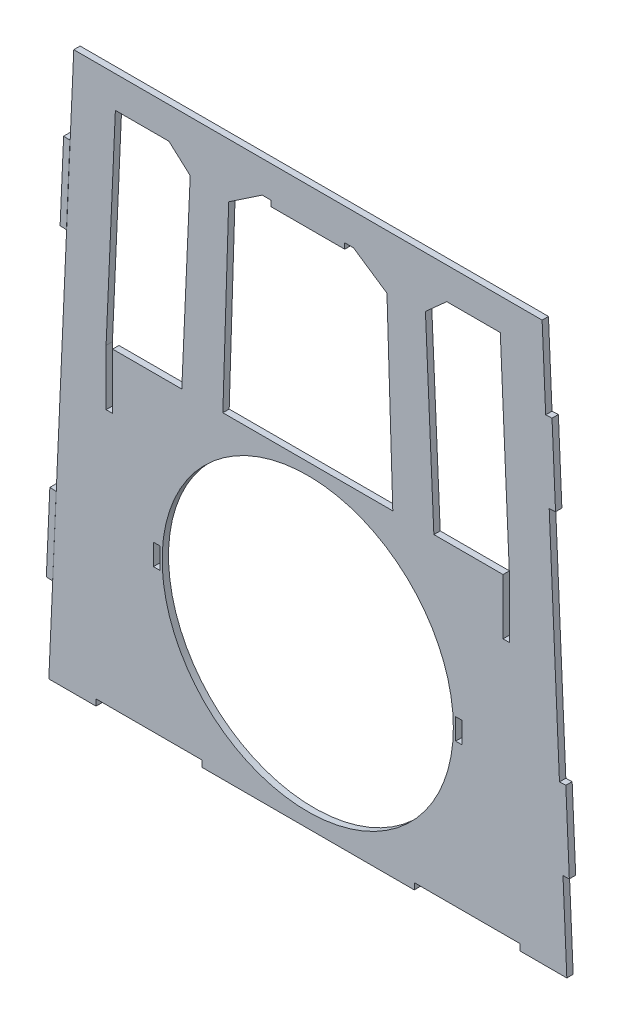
from build123d import *

# Parameters (mm, degrees)
BOSS_EXTRUDE1_DEPTH = 1.524
BOSS_EXTRUDE2_DEPTH = 1.524
SKETCH5_R           = 34.925
CUT_EXTRUDE2_DEPTH  = 2.54
SKETCH6_W           = 25.4
SKETCH6_H           = 1.524
CUT_EXTRUDE3_DEPTH  = 1.524
SKETCH7_W           = 1.524
SKETCH7_H           = 5.08
CUT_EXTRUDE4_DEPTH  = 1.524
SKETCH8_W           = 1.566256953
SKETCH8_H           = 13.370966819
SKETCH8_W_2         = 1.566256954
CUT_EXTRUDE5_DEPTH  = 1.524


with BuildPart() as part:
    # Sketch1 → Boss-Extrude1 (new body)
    with BuildSketch(Plane.XY):
        Polygon((-62.105258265, -13.26978038), (-56.120792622, 120.430311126), (56.212958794, 120.430311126), (62.142082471, -13.26978038), align=None)
        Polygon((-48.37052951, 62.891086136), (-46.142817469, 112.81804423), (-33.300712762, 112.81804423), (-28.190079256, 108.231578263), (-30.213145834, 62.891086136), align=None, mode=Mode.SUBTRACT)
        Polygon((30.24997004, 62.891086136), (48.407353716, 62.891086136), (46.179641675, 112.81804423), (33.337536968, 112.81804423), (28.226903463, 108.231578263), align=None, mode=Mode.SUBTRACT)
        Polygon((-20.364607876, 62.891086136), (20.401432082, 62.891086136), (18.999851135, 107.407679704), (10.972614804, 112.81804423), (8.865153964, 112.81804423), (8.865153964, 111.468807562), (-8.828329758, 111.468807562), (-8.828329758, 112.81804423), (-10.935790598, 112.81804423), (-18.963026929, 107.407679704), align=None, mode=Mode.SUBTRACT)
    extrude(amount=BOSS_EXTRUDE1_DEPTH)

    # Sketch2 → Boss-Extrude2 (add)
    with BuildSketch(Plane.XY.offset(1.524)):
        Polygon((-62.70469272, 7.612691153), (-61.860722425, 26.643986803), (-60.338218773, 26.57646918), (-61.182189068, 7.545173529), align=None)
        Polygon((57.910805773, 82.144333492), (59.433309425, 82.211851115), (58.589339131, 101.243146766), (57.066835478, 101.175629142), align=None)
        Polygon((61.219013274, 7.545173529), (62.741516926, 7.612691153), (61.897546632, 26.643986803), (60.375042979, 26.57646918), align=None)
        Polygon((-59.396485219, 82.211851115), (-58.552514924, 101.243146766), (-57.030011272, 101.175629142), (-57.873981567, 82.144333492), align=None)
    extrude(amount=-BOSS_EXTRUDE2_DEPTH)


with BuildPart() as boss_extrude2_piece_1:
    # of the separate pieces the step leaves, piece 1, a body of its own (boss_extrude2_pieces)
    add(part.part.solids().sort_by_distance((-62.105258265, -13.26978038, 0))[0])

    # Sketch5 → Cut-Extrude2 (cut)
    with BuildSketch(Plane.XY.offset(1.524)):
        with Locations((0, 25.14119341)):
            Circle(SKETCH5_R)
    extrude(amount=-CUT_EXTRUDE2_DEPTH, mode=Mode.SUBTRACT)

    # Sketch6 → Cut-Extrude3 (cut)
    with BuildSketch(Plane.XY.offset(1.524)):
        with Locations((38.24729306, -12.50778038)):
            Rectangle(SKETCH6_W, SKETCH6_H)
        with Locations((-38.091018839, -12.50778038)):
            Rectangle(SKETCH6_W, SKETCH6_H)
    extrude(amount=-CUT_EXTRUDE3_DEPTH, mode=Mode.SUBTRACT)

    # Sketch7 → Cut-Extrude4 (cut)
    with BuildSketch(Plane.XY.offset(1.524)):
        with Locations((-36.247543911, 25.14119341)):
            Rectangle(SKETCH7_W, SKETCH7_H)
        with Locations((36.247543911, 25.14119341)):
            Rectangle(SKETCH7_W, SKETCH7_H)
    extrude(amount=-CUT_EXTRUDE4_DEPTH, mode=Mode.SUBTRACT)

    # Sketch8 → Cut-Extrude5 (cut)
    with BuildSketch(Plane.XY.offset(1.524)):
        with Locations((47.62422524, 56.205602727)):
            Rectangle(SKETCH8_W, SKETCH8_H)
        with Locations((-47.587401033, 56.205602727)):
            Rectangle(SKETCH8_W_2, SKETCH8_H)
    extrude(amount=-CUT_EXTRUDE5_DEPTH, mode=Mode.SUBTRACT)


with BuildPart() as boss_extrude2_piece_2:
    # of the separate pieces the step leaves, piece 2, a body of its own (boss_extrude2_pieces)
    add(part.part.solids().sort_by_distance((-59.396485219, 82.211851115, 1.524))[0])


with BuildPart() as boss_extrude2_piece_3:
    # of the separate pieces the step leaves, piece 3, a body of its own (boss_extrude2_pieces)
    add(part.part.solids().sort_by_distance((-62.70469272, 7.612691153, 1.524))[0])


solid = Compound([boss_extrude2_piece_1.part, boss_extrude2_piece_2.part, boss_extrude2_piece_3.part])
